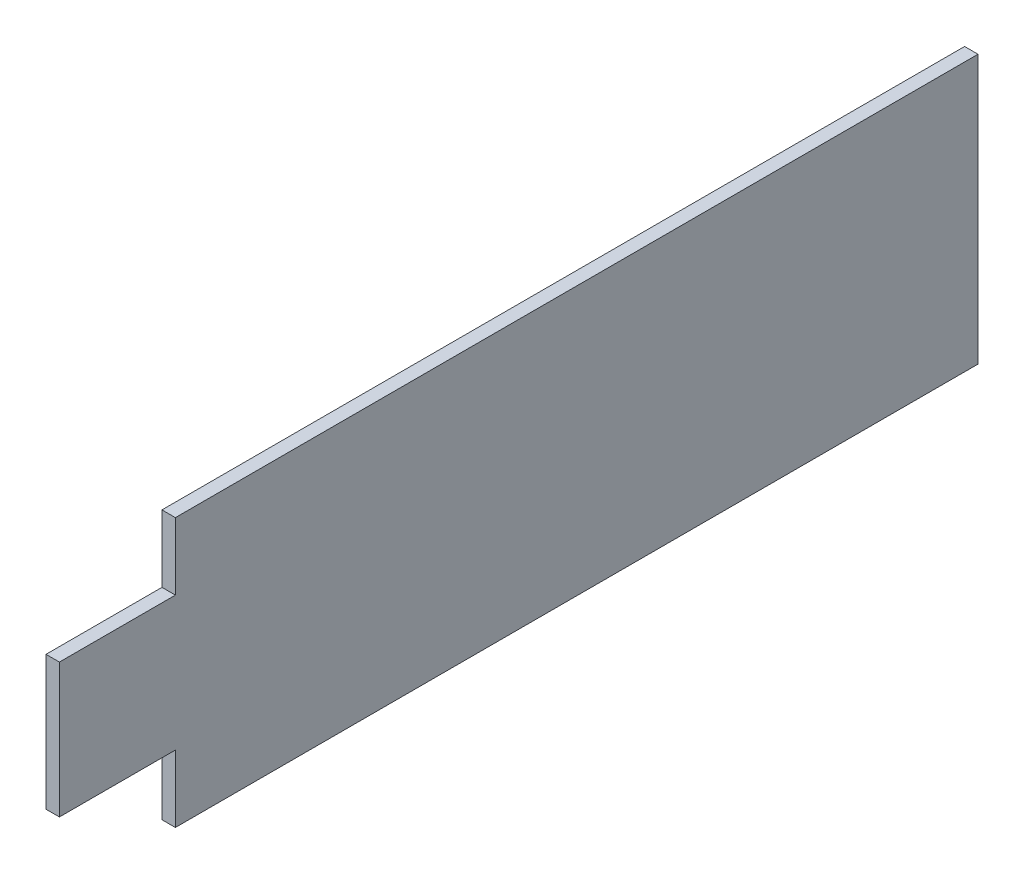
ISO-10303-21;
HEADER;
FILE_DESCRIPTION(('STEP AP214'),'2;1');
FILE_NAME('part.step','',(''),(''),'','','');
FILE_SCHEMA(('AUTOMOTIVE_DESIGN { 1 0 10303 214 1 1 1 1 }'));
ENDSEC;
DATA;
#1=APPLICATION_CONTEXT('core data for automotive mechanical design processes');
#2=APPLICATION_PROTOCOL_DEFINITION('international standard','automotive_design',2000,#1);
#3=PRODUCT_CONTEXT('',#1,'mechanical');
#4=PRODUCT('Part','Part','',(#3));
#5=PRODUCT_RELATED_PRODUCT_CATEGORY('part','',(#4));
#6=PRODUCT_DEFINITION_FORMATION('','',#4);
#7=PRODUCT_DEFINITION_CONTEXT('part definition',#1,'design');
#8=PRODUCT_DEFINITION('design','',#6,#7);
#9=PRODUCT_DEFINITION_SHAPE('','',#8);
#10=(LENGTH_UNIT() NAMED_UNIT(*) SI_UNIT(.MILLI.,.METRE.));
#11=(NAMED_UNIT(*) PLANE_ANGLE_UNIT() SI_UNIT($,.RADIAN.));
#12=(NAMED_UNIT(*) SI_UNIT($,.STERADIAN.) SOLID_ANGLE_UNIT());
#13=UNCERTAINTY_MEASURE_WITH_UNIT(LENGTH_MEASURE(1.E-05),#10,'distance_accuracy_value','');
#14=(GEOMETRIC_REPRESENTATION_CONTEXT(3) GLOBAL_UNCERTAINTY_ASSIGNED_CONTEXT((#13)) GLOBAL_UNIT_ASSIGNED_CONTEXT((#10,
#11,#12)) REPRESENTATION_CONTEXT('',''));
#15=CARTESIAN_POINT('',(0.,0.,0.));
#16=DIRECTION('',(0.,0.,1.));
#17=DIRECTION('',(1.,0.,0.));
#18=AXIS2_PLACEMENT_3D('',#15,#16,#17);
#19=CARTESIAN_POINT('',(1.,20.,-17.284161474));
#20=DIRECTION('',(0.,-1.,0.));
#21=DIRECTION('',(0.,0.,-1.));
#22=AXIS2_PLACEMENT_3D('',#19,#20,#21);
#23=PLANE('',#22);
#24=CARTESIAN_POINT('',(1.65319785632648E-09,20.,76.1927341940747));
#25=DIRECTION('',(0.,1.,0.));
#26=DIRECTION('',(0.,0.,1.));
#27=AXIS2_PLACEMENT_3D('',#24,#25,#26);
#28=CIRCLE('',#27,213.106897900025);
#29=CARTESIAN_POINT('',(0.999999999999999,20.,-136.911817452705));
#30=VERTEX_POINT('',#29);
#31=CARTESIAN_POINT('',(-0.999999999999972,20.,-136.91181745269));
#32=VERTEX_POINT('',#31);
#33=EDGE_CURVE('E172',#30,#32,#28,.T.);
#34=ORIENTED_EDGE('',*,*,#33,.T.);
#35=DIRECTION('',(0.,0.,1.));
#36=VECTOR('',#35,1.);
#37=CARTESIAN_POINT('',(-1.,20.,-17.284161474));
#38=LINE('',#37,#36);
#39=CARTESIAN_POINT('',(-1.,20.,-17.284161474));
#40=VERTEX_POINT('',#39);
#41=EDGE_CURVE('E137',#32,#40,#38,.T.);
#42=ORIENTED_EDGE('',*,*,#41,.T.);
#43=DIRECTION('',(-1.,0.,0.));
#44=VECTOR('',#43,1.);
#45=CARTESIAN_POINT('',(1.,20.,-17.284161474));
#46=LINE('',#45,#44);
#47=CARTESIAN_POINT('',(1.,20.,-17.284161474));
#48=VERTEX_POINT('',#47);
#49=EDGE_CURVE('E11',#48,#40,#46,.T.);
#50=ORIENTED_EDGE('',*,*,#49,.F.);
#51=DIRECTION('',(0.,0.,1.));
#52=VECTOR('',#51,1.);
#53=CARTESIAN_POINT('',(1.,20.,-17.284161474));
#54=LINE('',#53,#52);
#55=EDGE_CURVE('E96',#30,#48,#54,.T.);
#56=ORIENTED_EDGE('',*,*,#55,.F.);
#57=EDGE_LOOP('',(#34,#42,#50,#56));
#58=FACE_BOUND('',#57,.T.);
#59=ADVANCED_FACE('F38',(#58),#23,.F.);
#60=CARTESIAN_POINT('',(1.,-20.,-17.284161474));
#61=DIRECTION('',(0.,1.,0.));
#62=DIRECTION('',(0.,0.,1.));
#63=AXIS2_PLACEMENT_3D('',#60,#61,#62);
#64=PLANE('',#63);
#65=CARTESIAN_POINT('',(1.65319785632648E-09,-20.,76.1927341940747));
#66=DIRECTION('',(0.,1.,0.));
#67=DIRECTION('',(0.,0.,1.));
#68=AXIS2_PLACEMENT_3D('',#65,#66,#67);
#69=CIRCLE('',#68,213.106897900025);
#70=CARTESIAN_POINT('',(0.999999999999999,-20.,-136.911817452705));
#71=VERTEX_POINT('',#70);
#72=CARTESIAN_POINT('',(-1.,-20.,-136.91181745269));
#73=VERTEX_POINT('',#72);
#74=EDGE_CURVE('E52',#71,#73,#69,.T.);
#75=ORIENTED_EDGE('',*,*,#74,.F.);
#76=DIRECTION('',(0.,0.,-1.));
#77=VECTOR('',#76,1.);
#78=CARTESIAN_POINT('',(1.,-20.,-17.284161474));
#79=LINE('',#78,#77);
#80=CARTESIAN_POINT('',(1.,-20.,-17.284161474));
#81=VERTEX_POINT('',#80);
#82=EDGE_CURVE('E131',#81,#71,#79,.T.);
#83=ORIENTED_EDGE('',*,*,#82,.F.);
#84=DIRECTION('',(-1.,0.,0.));
#85=VECTOR('',#84,1.);
#86=CARTESIAN_POINT('',(1.,-20.,-17.284161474));
#87=LINE('',#86,#85);
#88=CARTESIAN_POINT('',(-1.,-20.,-17.284161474));
#89=VERTEX_POINT('',#88);
#90=EDGE_CURVE('E136',#81,#89,#87,.T.);
#91=ORIENTED_EDGE('',*,*,#90,.T.);
#92=DIRECTION('',(0.,0.,-1.));
#93=VECTOR('',#92,1.);
#94=CARTESIAN_POINT('',(-1.,-20.,-17.284161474));
#95=LINE('',#94,#93);
#96=EDGE_CURVE('E148',#89,#73,#95,.T.);
#97=ORIENTED_EDGE('',*,*,#96,.T.);
#98=EDGE_LOOP('',(#75,#83,#91,#97));
#99=FACE_BOUND('',#98,.T.);
#100=ADVANCED_FACE('F167',(#99),#64,.F.);
#101=CARTESIAN_POINT('',(1.,0.,0.));
#102=DIRECTION('',(-1.,0.,0.));
#103=DIRECTION('',(0.,0.,1.));
#104=AXIS2_PLACEMENT_3D('',#101,#102,#103);
#105=PLANE('',#104);
#106=DIRECTION('',(0.,1.,0.));
#107=VECTOR('',#106,1.);
#108=CARTESIAN_POINT('',(0.999999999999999,-20.,-136.911817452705));
#109=LINE('',#108,#107);
#110=EDGE_CURVE('E140',#71,#30,#109,.T.);
#111=ORIENTED_EDGE('',*,*,#110,.T.);
#112=ORIENTED_EDGE('',*,*,#55,.T.);
#113=DIRECTION('',(0.,-1.,0.));
#114=VECTOR('',#113,1.);
#115=CARTESIAN_POINT('',(1.,20.,-17.284161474));
#116=LINE('',#115,#114);
#117=CARTESIAN_POINT('',(1.,10.,-17.284161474));
#118=VERTEX_POINT('',#117);
#119=EDGE_CURVE('E182',#48,#118,#116,.T.);
#120=ORIENTED_EDGE('',*,*,#119,.T.);
#121=DIRECTION('',(0.,0.,1.));
#122=VECTOR('',#121,1.);
#123=CARTESIAN_POINT('',(1.,10.,-17.284161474));
#124=LINE('',#123,#122);
#125=CARTESIAN_POINT('',(1.,10.,0.));
#126=VERTEX_POINT('',#125);
#127=EDGE_CURVE('E114',#118,#126,#124,.T.);
#128=ORIENTED_EDGE('',*,*,#127,.T.);
#129=DIRECTION('',(0.,-1.,0.));
#130=VECTOR('',#129,1.);
#131=CARTESIAN_POINT('',(1.,10.,0.));
#132=LINE('',#131,#130);
#133=CARTESIAN_POINT('',(1.,-10.,0.));
#134=VERTEX_POINT('',#133);
#135=EDGE_CURVE('E107',#126,#134,#132,.T.);
#136=ORIENTED_EDGE('',*,*,#135,.T.);
#137=DIRECTION('',(0.,0.,-1.));
#138=VECTOR('',#137,1.);
#139=CARTESIAN_POINT('',(1.,-10.,0.));
#140=LINE('',#139,#138);
#141=CARTESIAN_POINT('',(1.,-10.,-17.284161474));
#142=VERTEX_POINT('',#141);
#143=EDGE_CURVE('E111',#134,#142,#140,.T.);
#144=ORIENTED_EDGE('',*,*,#143,.T.);
#145=DIRECTION('',(0.,-1.,0.));
#146=VECTOR('',#145,1.);
#147=CARTESIAN_POINT('',(1.,-10.,-17.284161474));
#148=LINE('',#147,#146);
#149=EDGE_CURVE('E61',#142,#81,#148,.T.);
#150=ORIENTED_EDGE('',*,*,#149,.T.);
#151=ORIENTED_EDGE('',*,*,#82,.T.);
#152=EDGE_LOOP('',(#111,#112,#120,#128,#136,#144,#150,#151));
#153=FACE_BOUND('',#152,.T.);
#154=ADVANCED_FACE('F109',(#153),#105,.F.);
#155=CARTESIAN_POINT('',(-1.,0.,0.));
#156=DIRECTION('',(-1.,0.,0.));
#157=DIRECTION('',(0.,0.,1.));
#158=AXIS2_PLACEMENT_3D('',#155,#156,#157);
#159=PLANE('',#158);
#160=ORIENTED_EDGE('',*,*,#41,.F.);
#161=DIRECTION('',(0.,1.,0.));
#162=VECTOR('',#161,1.);
#163=CARTESIAN_POINT('',(-0.999999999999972,-20.,-136.91181745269));
#164=LINE('',#163,#162);
#165=EDGE_CURVE('E174',#73,#32,#164,.T.);
#166=ORIENTED_EDGE('',*,*,#165,.F.);
#167=ORIENTED_EDGE('',*,*,#96,.F.);
#168=DIRECTION('',(0.,-1.,0.));
#169=VECTOR('',#168,1.);
#170=CARTESIAN_POINT('',(-1.,-10.,-17.284161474));
#171=LINE('',#170,#169);
#172=CARTESIAN_POINT('',(-1.,-10.,-17.284161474));
#173=VERTEX_POINT('',#172);
#174=EDGE_CURVE('E88',#173,#89,#171,.T.);
#175=ORIENTED_EDGE('',*,*,#174,.F.);
#176=DIRECTION('',(0.,0.,-1.));
#177=VECTOR('',#176,1.);
#178=CARTESIAN_POINT('',(-1.,-10.,0.));
#179=LINE('',#178,#177);
#180=CARTESIAN_POINT('',(-1.,-10.,0.));
#181=VERTEX_POINT('',#180);
#182=EDGE_CURVE('E145',#181,#173,#179,.T.);
#183=ORIENTED_EDGE('',*,*,#182,.F.);
#184=DIRECTION('',(0.,-1.,0.));
#185=VECTOR('',#184,1.);
#186=CARTESIAN_POINT('',(-1.,10.,0.));
#187=LINE('',#186,#185);
#188=CARTESIAN_POINT('',(-1.,10.,0.));
#189=VERTEX_POINT('',#188);
#190=EDGE_CURVE('E123',#189,#181,#187,.T.);
#191=ORIENTED_EDGE('',*,*,#190,.F.);
#192=DIRECTION('',(0.,0.,1.));
#193=VECTOR('',#192,1.);
#194=CARTESIAN_POINT('',(-1.,10.,-17.284161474));
#195=LINE('',#194,#193);
#196=CARTESIAN_POINT('',(-1.,10.,-17.284161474));
#197=VERTEX_POINT('',#196);
#198=EDGE_CURVE('E142',#197,#189,#195,.T.);
#199=ORIENTED_EDGE('',*,*,#198,.F.);
#200=DIRECTION('',(0.,-1.,0.));
#201=VECTOR('',#200,1.);
#202=CARTESIAN_POINT('',(-1.,20.,-17.284161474));
#203=LINE('',#202,#201);
#204=EDGE_CURVE('E139',#40,#197,#203,.T.);
#205=ORIENTED_EDGE('',*,*,#204,.F.);
#206=EDGE_LOOP('',(#160,#166,#167,#175,#183,#191,#199,#205));
#207=FACE_BOUND('',#206,.T.);
#208=ADVANCED_FACE('F162',(#207),#159,.T.);
#209=CARTESIAN_POINT('',(1.,20.,-17.284161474));
#210=DIRECTION('',(0.,0.,-1.));
#211=DIRECTION('',(0.,1.,0.));
#212=AXIS2_PLACEMENT_3D('',#209,#210,#211);
#213=PLANE('',#212);
#214=ORIENTED_EDGE('',*,*,#204,.T.);
#215=DIRECTION('',(-1.,0.,0.));
#216=VECTOR('',#215,1.);
#217=CARTESIAN_POINT('',(1.,10.,-17.284161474));
#218=LINE('',#217,#216);
#219=EDGE_CURVE('E45',#118,#197,#218,.T.);
#220=ORIENTED_EDGE('',*,*,#219,.F.);
#221=ORIENTED_EDGE('',*,*,#119,.F.);
#222=ORIENTED_EDGE('',*,*,#49,.T.);
#223=EDGE_LOOP('',(#214,#220,#221,#222));
#224=FACE_BOUND('',#223,.T.);
#225=ADVANCED_FACE('F184',(#224),#213,.F.);
#226=CARTESIAN_POINT('',(1.,10.,-17.284161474));
#227=DIRECTION('',(0.,-1.,0.));
#228=DIRECTION('',(0.,0.,-1.));
#229=AXIS2_PLACEMENT_3D('',#226,#227,#228);
#230=PLANE('',#229);
#231=ORIENTED_EDGE('',*,*,#198,.T.);
#232=DIRECTION('',(-1.,0.,0.));
#233=VECTOR('',#232,1.);
#234=CARTESIAN_POINT('',(1.,10.,0.));
#235=LINE('',#234,#233);
#236=EDGE_CURVE('E126',#126,#189,#235,.T.);
#237=ORIENTED_EDGE('',*,*,#236,.F.);
#238=ORIENTED_EDGE('',*,*,#127,.F.);
#239=ORIENTED_EDGE('',*,*,#219,.T.);
#240=EDGE_LOOP('',(#231,#237,#238,#239));
#241=FACE_BOUND('',#240,.T.);
#242=ADVANCED_FACE('F157',(#241),#230,.F.);
#243=CARTESIAN_POINT('',(1.,10.,0.));
#244=DIRECTION('',(0.,0.,-1.));
#245=DIRECTION('',(-1.,0.,0.));
#246=AXIS2_PLACEMENT_3D('',#243,#244,#245);
#247=PLANE('',#246);
#248=ORIENTED_EDGE('',*,*,#190,.T.);
#249=DIRECTION('',(-1.,0.,0.));
#250=VECTOR('',#249,1.);
#251=CARTESIAN_POINT('',(1.,-10.,0.));
#252=LINE('',#251,#250);
#253=EDGE_CURVE('E120',#134,#181,#252,.T.);
#254=ORIENTED_EDGE('',*,*,#253,.F.);
#255=ORIENTED_EDGE('',*,*,#135,.F.);
#256=ORIENTED_EDGE('',*,*,#236,.T.);
#257=EDGE_LOOP('',(#248,#254,#255,#256));
#258=FACE_BOUND('',#257,.T.);
#259=ADVANCED_FACE('F121',(#258),#247,.F.);
#260=CARTESIAN_POINT('',(1.,-10.,0.));
#261=DIRECTION('',(0.,1.,0.));
#262=DIRECTION('',(0.,0.,1.));
#263=AXIS2_PLACEMENT_3D('',#260,#261,#262);
#264=PLANE('',#263);
#265=ORIENTED_EDGE('',*,*,#182,.T.);
#266=DIRECTION('',(-1.,0.,0.));
#267=VECTOR('',#266,1.);
#268=CARTESIAN_POINT('',(1.,-10.,-17.284161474));
#269=LINE('',#268,#267);
#270=EDGE_CURVE('E127',#142,#173,#269,.T.);
#271=ORIENTED_EDGE('',*,*,#270,.F.);
#272=ORIENTED_EDGE('',*,*,#143,.F.);
#273=ORIENTED_EDGE('',*,*,#253,.T.);
#274=EDGE_LOOP('',(#265,#271,#272,#273));
#275=FACE_BOUND('',#274,.T.);
#276=ADVANCED_FACE('F129',(#275),#264,.F.);
#277=CARTESIAN_POINT('',(1.,-10.,-17.284161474));
#278=DIRECTION('',(0.,0.,-1.));
#279=DIRECTION('',(0.,1.,0.));
#280=AXIS2_PLACEMENT_3D('',#277,#278,#279);
#281=PLANE('',#280);
#282=ORIENTED_EDGE('',*,*,#174,.T.);
#283=ORIENTED_EDGE('',*,*,#90,.F.);
#284=ORIENTED_EDGE('',*,*,#149,.F.);
#285=ORIENTED_EDGE('',*,*,#270,.T.);
#286=EDGE_LOOP('',(#282,#283,#284,#285));
#287=FACE_BOUND('',#286,.T.);
#288=ADVANCED_FACE('F164',(#287),#281,.F.);
#289=CARTESIAN_POINT('',(1.65319785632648E-09,-20.,76.1927341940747));
#290=DIRECTION('',(0.,1.,0.));
#291=DIRECTION('',(0.,0.,1.));
#292=AXIS2_PLACEMENT_3D('',#289,#290,#291);
#293=CYLINDRICAL_SURFACE('',#292,213.106897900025);
#294=ORIENTED_EDGE('',*,*,#33,.F.);
#295=ORIENTED_EDGE('',*,*,#110,.F.);
#296=ORIENTED_EDGE('',*,*,#74,.T.);
#297=ORIENTED_EDGE('',*,*,#165,.T.);
#298=EDGE_LOOP('',(#294,#295,#296,#297));
#299=FACE_BOUND('',#298,.T.);
#300=ADVANCED_FACE('F173',(#299),#293,.T.);
#301=CLOSED_SHELL('',(#59,#100,#154,#208,#225,#242,#259,#276,#288,#300));
#302=MANIFOLD_SOLID_BREP('B2',#301);
#303=ADVANCED_BREP_SHAPE_REPRESENTATION('',(#18,#302),#14);
#304=SHAPE_DEFINITION_REPRESENTATION(#9,#303);
ENDSEC;
END-ISO-10303-21;
